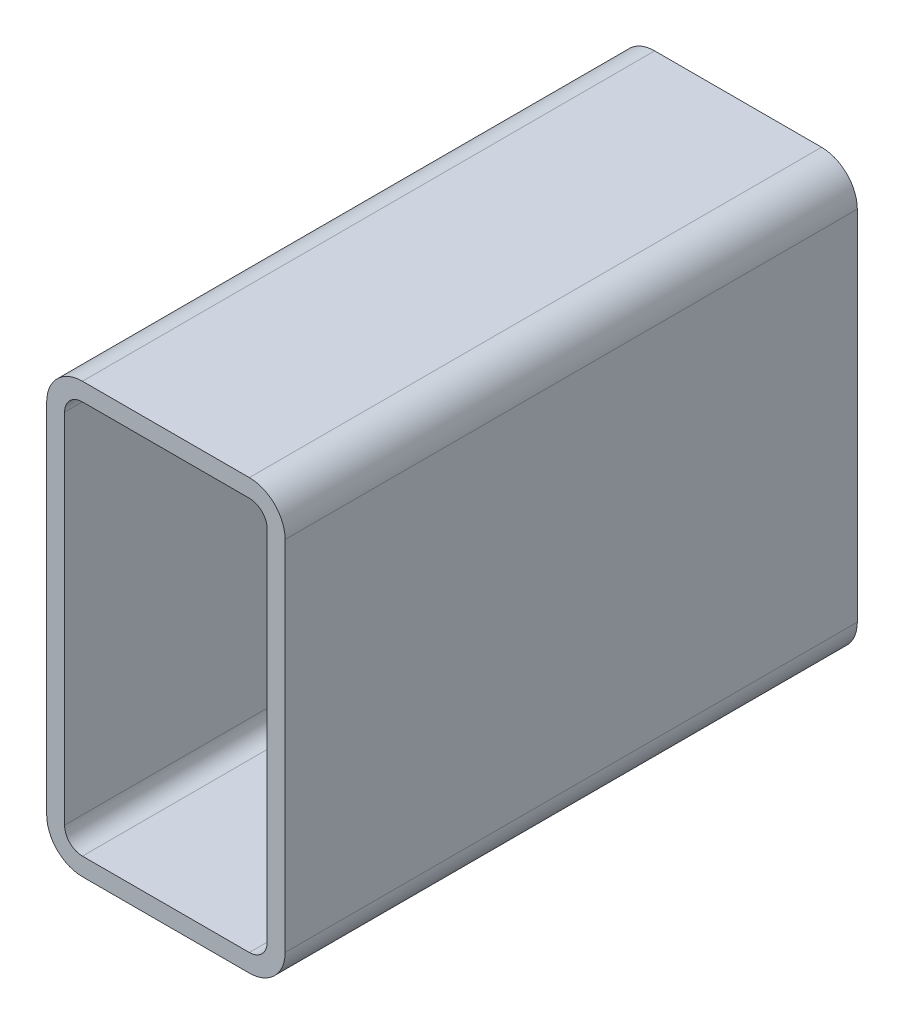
ISO-10303-21;
HEADER;
FILE_DESCRIPTION(('STEP AP214'),'2;1');
FILE_NAME('part.step','',(''),(''),'','','');
FILE_SCHEMA(('AUTOMOTIVE_DESIGN { 1 0 10303 214 1 1 1 1 }'));
ENDSEC;
DATA;
#1=APPLICATION_CONTEXT('core data for automotive mechanical design processes');
#2=APPLICATION_PROTOCOL_DEFINITION('international standard','automotive_design',2000,#1);
#3=PRODUCT_CONTEXT('',#1,'mechanical');
#4=PRODUCT('Part','Part','',(#3));
#5=PRODUCT_RELATED_PRODUCT_CATEGORY('part','',(#4));
#6=PRODUCT_DEFINITION_FORMATION('','',#4);
#7=PRODUCT_DEFINITION_CONTEXT('part definition',#1,'design');
#8=PRODUCT_DEFINITION('design','',#6,#7);
#9=PRODUCT_DEFINITION_SHAPE('','',#8);
#10=(LENGTH_UNIT() NAMED_UNIT(*) SI_UNIT(.MILLI.,.METRE.));
#11=(NAMED_UNIT(*) PLANE_ANGLE_UNIT() SI_UNIT($,.RADIAN.));
#12=(NAMED_UNIT(*) SI_UNIT($,.STERADIAN.) SOLID_ANGLE_UNIT());
#13=UNCERTAINTY_MEASURE_WITH_UNIT(LENGTH_MEASURE(1.E-05),#10,'distance_accuracy_value','');
#14=(GEOMETRIC_REPRESENTATION_CONTEXT(3) GLOBAL_UNCERTAINTY_ASSIGNED_CONTEXT((#13)) GLOBAL_UNIT_ASSIGNED_CONTEXT((#10,
#11,#12)) REPRESENTATION_CONTEXT('',''));
#15=CARTESIAN_POINT('',(0.,0.,0.));
#16=DIRECTION('',(0.,0.,1.));
#17=DIRECTION('',(1.,0.,0.));
#18=AXIS2_PLACEMENT_3D('',#15,#16,#17);
#19=CARTESIAN_POINT('',(108.811239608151,20.9932223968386,304.8));
#20=DIRECTION('',(0.,0.,1.));
#21=DIRECTION('',(1.,0.,0.));
#22=AXIS2_PLACEMENT_3D('',#19,#20,#21);
#23=PLANE('',#22);
#24=CARTESIAN_POINT('',(108.811239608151,20.9932223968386,304.8));
#25=DIRECTION('',(0.,0.,1.));
#26=DIRECTION('',(1.,0.,0.));
#27=AXIS2_PLACEMENT_3D('',#24,#25,#26);
#28=CIRCLE('',#27,19.05);
#29=CARTESIAN_POINT('',(108.811239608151,1.94322239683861,304.8));
#30=VERTEX_POINT('',#29);
#31=CARTESIAN_POINT('',(127.861239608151,20.9932223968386,304.8));
#32=VERTEX_POINT('',#31);
#33=EDGE_CURVE('E211',#30,#32,#28,.T.);
#34=ORIENTED_EDGE('',*,*,#33,.T.);
#35=DIRECTION('',(0.,1.,0.));
#36=VECTOR('',#35,1.);
#37=CARTESIAN_POINT('',(127.861239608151,211.493222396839,304.8));
#38=LINE('',#37,#36);
#39=CARTESIAN_POINT('',(127.861239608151,211.493222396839,304.8));
#40=VERTEX_POINT('',#39);
#41=EDGE_CURVE('E214',#32,#40,#38,.T.);
#42=ORIENTED_EDGE('',*,*,#41,.T.);
#43=CARTESIAN_POINT('',(108.811239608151,211.493222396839,304.8));
#44=DIRECTION('',(0.,0.,1.));
#45=DIRECTION('',(1.,0.,0.));
#46=AXIS2_PLACEMENT_3D('',#43,#44,#45);
#47=CIRCLE('',#46,19.05);
#48=CARTESIAN_POINT('',(108.811239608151,230.543222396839,304.8));
#49=VERTEX_POINT('',#48);
#50=EDGE_CURVE('E217',#40,#49,#47,.T.);
#51=ORIENTED_EDGE('',*,*,#50,.T.);
#52=DIRECTION('',(-1.,0.,0.));
#53=VECTOR('',#52,1.);
#54=CARTESIAN_POINT('',(19.9112396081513,230.543222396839,304.8));
#55=LINE('',#54,#53);
#56=CARTESIAN_POINT('',(19.9112396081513,230.543222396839,304.8));
#57=VERTEX_POINT('',#56);
#58=EDGE_CURVE('E219',#49,#57,#55,.T.);
#59=ORIENTED_EDGE('',*,*,#58,.T.);
#60=CARTESIAN_POINT('',(19.9112396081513,211.493222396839,304.8));
#61=DIRECTION('',(0.,0.,1.));
#62=DIRECTION('',(1.,0.,0.));
#63=AXIS2_PLACEMENT_3D('',#60,#61,#62);
#64=CIRCLE('',#63,19.05);
#65=CARTESIAN_POINT('',(0.8612396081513,211.493222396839,304.8));
#66=VERTEX_POINT('',#65);
#67=EDGE_CURVE('E221',#57,#66,#64,.T.);
#68=ORIENTED_EDGE('',*,*,#67,.T.);
#69=DIRECTION('',(0.,-1.,0.));
#70=VECTOR('',#69,1.);
#71=CARTESIAN_POINT('',(0.8612396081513,20.9932223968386,304.8));
#72=LINE('',#71,#70);
#73=CARTESIAN_POINT('',(0.8612396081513,20.9932223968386,304.8));
#74=VERTEX_POINT('',#73);
#75=EDGE_CURVE('E223',#66,#74,#72,.T.);
#76=ORIENTED_EDGE('',*,*,#75,.T.);
#77=CARTESIAN_POINT('',(19.9112396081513,20.9932223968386,304.8));
#78=DIRECTION('',(0.,0.,1.));
#79=DIRECTION('',(1.,0.,0.));
#80=AXIS2_PLACEMENT_3D('',#77,#78,#79);
#81=CIRCLE('',#80,19.05);
#82=CARTESIAN_POINT('',(19.9112396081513,1.94322239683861,304.8));
#83=VERTEX_POINT('',#82);
#84=EDGE_CURVE('E225',#74,#83,#81,.T.);
#85=ORIENTED_EDGE('',*,*,#84,.T.);
#86=DIRECTION('',(1.,0.,0.));
#87=VECTOR('',#86,1.);
#88=CARTESIAN_POINT('',(108.811239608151,1.94322239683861,304.8));
#89=LINE('',#88,#87);
#90=EDGE_CURVE('E227',#83,#30,#89,.T.);
#91=ORIENTED_EDGE('',*,*,#90,.T.);
#92=EDGE_LOOP('',(#34,#42,#51,#59,#68,#76,#85,#91));
#93=FACE_BOUND('',#92,.T.);
#94=DIRECTION('',(0.,-1.,0.));
#95=VECTOR('',#94,1.);
#96=CARTESIAN_POINT('',(10.3862396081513,20.9932223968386,304.8));
#97=LINE('',#96,#95);
#98=CARTESIAN_POINT('',(10.3862396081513,211.493222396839,304.8));
#99=VERTEX_POINT('',#98);
#100=CARTESIAN_POINT('',(10.3862396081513,20.9932223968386,304.8));
#101=VERTEX_POINT('',#100);
#102=EDGE_CURVE('E154',#99,#101,#97,.T.);
#103=ORIENTED_EDGE('',*,*,#102,.F.);
#104=CARTESIAN_POINT('',(19.9112396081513,211.493222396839,304.8));
#105=DIRECTION('',(0.,0.,1.));
#106=DIRECTION('',(1.,0.,0.));
#107=AXIS2_PLACEMENT_3D('',#104,#105,#106);
#108=CIRCLE('',#107,9.525);
#109=CARTESIAN_POINT('',(19.9112396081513,221.018222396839,304.8));
#110=VERTEX_POINT('',#109);
#111=EDGE_CURVE('E146',#110,#99,#108,.T.);
#112=ORIENTED_EDGE('',*,*,#111,.F.);
#113=DIRECTION('',(-1.,0.,0.));
#114=VECTOR('',#113,1.);
#115=CARTESIAN_POINT('',(19.9112396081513,221.018222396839,304.8));
#116=LINE('',#115,#114);
#117=CARTESIAN_POINT('',(108.811239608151,221.018222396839,304.8));
#118=VERTEX_POINT('',#117);
#119=EDGE_CURVE('E179',#118,#110,#116,.T.);
#120=ORIENTED_EDGE('',*,*,#119,.F.);
#121=CARTESIAN_POINT('',(108.811239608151,211.493222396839,304.8));
#122=DIRECTION('',(0.,0.,1.));
#123=DIRECTION('',(1.,0.,0.));
#124=AXIS2_PLACEMENT_3D('',#121,#122,#123);
#125=CIRCLE('',#124,9.525);
#126=CARTESIAN_POINT('',(118.336239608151,211.493222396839,304.8));
#127=VERTEX_POINT('',#126);
#128=EDGE_CURVE('E177',#127,#118,#125,.T.);
#129=ORIENTED_EDGE('',*,*,#128,.F.);
#130=DIRECTION('',(0.,1.,0.));
#131=VECTOR('',#130,1.);
#132=CARTESIAN_POINT('',(118.336239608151,211.493222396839,304.8));
#133=LINE('',#132,#131);
#134=CARTESIAN_POINT('',(118.336239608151,20.9932223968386,304.8));
#135=VERTEX_POINT('',#134);
#136=EDGE_CURVE('E175',#135,#127,#133,.T.);
#137=ORIENTED_EDGE('',*,*,#136,.F.);
#138=CARTESIAN_POINT('',(108.811239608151,20.9932223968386,304.8));
#139=DIRECTION('',(0.,0.,1.));
#140=DIRECTION('',(1.,0.,0.));
#141=AXIS2_PLACEMENT_3D('',#138,#139,#140);
#142=CIRCLE('',#141,9.52500000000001);
#143=CARTESIAN_POINT('',(108.811239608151,11.4682223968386,304.8));
#144=VERTEX_POINT('',#143);
#145=EDGE_CURVE('E173',#144,#135,#142,.T.);
#146=ORIENTED_EDGE('',*,*,#145,.F.);
#147=DIRECTION('',(1.,0.,0.));
#148=VECTOR('',#147,1.);
#149=CARTESIAN_POINT('',(108.811239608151,11.4682223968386,304.8));
#150=LINE('',#149,#148);
#151=CARTESIAN_POINT('',(19.9112396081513,11.4682223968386,304.8));
#152=VERTEX_POINT('',#151);
#153=EDGE_CURVE('E169',#152,#144,#150,.T.);
#154=ORIENTED_EDGE('',*,*,#153,.F.);
#155=CARTESIAN_POINT('',(19.9112396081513,20.9932223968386,304.8));
#156=DIRECTION('',(0.,0.,1.));
#157=DIRECTION('',(1.,0.,0.));
#158=AXIS2_PLACEMENT_3D('',#155,#156,#157);
#159=CIRCLE('',#158,9.525);
#160=EDGE_CURVE('E167',#101,#152,#159,.T.);
#161=ORIENTED_EDGE('',*,*,#160,.F.);
#162=EDGE_LOOP('',(#103,#112,#120,#129,#137,#146,#154,#161));
#163=FACE_BOUND('',#162,.T.);
#164=ADVANCED_FACE('F33',(#93,#163),#23,.T.);
#165=CARTESIAN_POINT('',(108.811239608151,20.9932223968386,0.));
#166=DIRECTION('',(0.,0.,1.));
#167=DIRECTION('',(1.,0.,0.));
#168=AXIS2_PLACEMENT_3D('',#165,#166,#167);
#169=PLANE('',#168);
#170=CARTESIAN_POINT('',(108.811239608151,20.9932223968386,0.));
#171=DIRECTION('',(0.,0.,1.));
#172=DIRECTION('',(1.,0.,0.));
#173=AXIS2_PLACEMENT_3D('',#170,#171,#172);
#174=CIRCLE('',#173,19.05);
#175=CARTESIAN_POINT('',(108.811239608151,1.94322239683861,0.));
#176=VERTEX_POINT('',#175);
#177=CARTESIAN_POINT('',(127.861239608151,20.9932223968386,0.));
#178=VERTEX_POINT('',#177);
#179=EDGE_CURVE('E162',#176,#178,#174,.T.);
#180=ORIENTED_EDGE('',*,*,#179,.F.);
#181=DIRECTION('',(1.,0.,0.));
#182=VECTOR('',#181,1.);
#183=CARTESIAN_POINT('',(108.811239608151,1.94322239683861,0.));
#184=LINE('',#183,#182);
#185=CARTESIAN_POINT('',(19.9112396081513,1.94322239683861,0.));
#186=VERTEX_POINT('',#185);
#187=EDGE_CURVE('E215',#186,#176,#184,.T.);
#188=ORIENTED_EDGE('',*,*,#187,.F.);
#189=CARTESIAN_POINT('',(19.9112396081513,20.9932223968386,0.));
#190=DIRECTION('',(0.,0.,1.));
#191=DIRECTION('',(1.,0.,0.));
#192=AXIS2_PLACEMENT_3D('',#189,#190,#191);
#193=CIRCLE('',#192,19.05);
#194=CARTESIAN_POINT('',(0.8612396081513,20.9932223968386,0.));
#195=VERTEX_POINT('',#194);
#196=EDGE_CURVE('E242',#195,#186,#193,.T.);
#197=ORIENTED_EDGE('',*,*,#196,.F.);
#198=DIRECTION('',(0.,-1.,0.));
#199=VECTOR('',#198,1.);
#200=CARTESIAN_POINT('',(0.8612396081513,20.9932223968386,0.));
#201=LINE('',#200,#199);
#202=CARTESIAN_POINT('',(0.8612396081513,211.493222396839,0.));
#203=VERTEX_POINT('',#202);
#204=EDGE_CURVE('E240',#203,#195,#201,.T.);
#205=ORIENTED_EDGE('',*,*,#204,.F.);
#206=CARTESIAN_POINT('',(19.9112396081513,211.493222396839,0.));
#207=DIRECTION('',(0.,0.,1.));
#208=DIRECTION('',(1.,0.,0.));
#209=AXIS2_PLACEMENT_3D('',#206,#207,#208);
#210=CIRCLE('',#209,19.05);
#211=CARTESIAN_POINT('',(19.9112396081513,230.543222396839,0.));
#212=VERTEX_POINT('',#211);
#213=EDGE_CURVE('E238',#212,#203,#210,.T.);
#214=ORIENTED_EDGE('',*,*,#213,.F.);
#215=DIRECTION('',(-1.,0.,0.));
#216=VECTOR('',#215,1.);
#217=CARTESIAN_POINT('',(19.9112396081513,230.543222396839,0.));
#218=LINE('',#217,#216);
#219=CARTESIAN_POINT('',(108.811239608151,230.543222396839,0.));
#220=VERTEX_POINT('',#219);
#221=EDGE_CURVE('E236',#220,#212,#218,.T.);
#222=ORIENTED_EDGE('',*,*,#221,.F.);
#223=CARTESIAN_POINT('',(108.811239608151,211.493222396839,0.));
#224=DIRECTION('',(0.,0.,1.));
#225=DIRECTION('',(1.,0.,0.));
#226=AXIS2_PLACEMENT_3D('',#223,#224,#225);
#227=CIRCLE('',#226,19.05);
#228=CARTESIAN_POINT('',(127.861239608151,211.493222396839,0.));
#229=VERTEX_POINT('',#228);
#230=EDGE_CURVE('E234',#229,#220,#227,.T.);
#231=ORIENTED_EDGE('',*,*,#230,.F.);
#232=DIRECTION('',(0.,1.,0.));
#233=VECTOR('',#232,1.);
#234=CARTESIAN_POINT('',(127.861239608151,211.493222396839,0.));
#235=LINE('',#234,#233);
#236=EDGE_CURVE('E232',#178,#229,#235,.T.);
#237=ORIENTED_EDGE('',*,*,#236,.F.);
#238=EDGE_LOOP('',(#180,#188,#197,#205,#214,#222,#231,#237));
#239=FACE_BOUND('',#238,.T.);
#240=CARTESIAN_POINT('',(19.9112396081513,211.493222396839,0.));
#241=DIRECTION('',(0.,0.,1.));
#242=DIRECTION('',(1.,0.,0.));
#243=AXIS2_PLACEMENT_3D('',#240,#241,#242);
#244=CIRCLE('',#243,9.525);
#245=CARTESIAN_POINT('',(19.9112396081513,221.018222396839,0.));
#246=VERTEX_POINT('',#245);
#247=CARTESIAN_POINT('',(10.3862396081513,211.493222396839,0.));
#248=VERTEX_POINT('',#247);
#249=EDGE_CURVE('E56',#246,#248,#244,.T.);
#250=ORIENTED_EDGE('',*,*,#249,.T.);
#251=DIRECTION('',(0.,-1.,0.));
#252=VECTOR('',#251,1.);
#253=CARTESIAN_POINT('',(10.3862396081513,20.9932223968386,0.));
#254=LINE('',#253,#252);
#255=CARTESIAN_POINT('',(10.3862396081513,20.9932223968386,0.));
#256=VERTEX_POINT('',#255);
#257=EDGE_CURVE('E161',#248,#256,#254,.T.);
#258=ORIENTED_EDGE('',*,*,#257,.T.);
#259=CARTESIAN_POINT('',(19.9112396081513,20.9932223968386,0.));
#260=DIRECTION('',(0.,0.,1.));
#261=DIRECTION('',(1.,0.,0.));
#262=AXIS2_PLACEMENT_3D('',#259,#260,#261);
#263=CIRCLE('',#262,9.525);
#264=CARTESIAN_POINT('',(19.9112396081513,11.4682223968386,0.));
#265=VERTEX_POINT('',#264);
#266=EDGE_CURVE('E183',#256,#265,#263,.T.);
#267=ORIENTED_EDGE('',*,*,#266,.T.);
#268=DIRECTION('',(1.,0.,0.));
#269=VECTOR('',#268,1.);
#270=CARTESIAN_POINT('',(108.811239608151,11.4682223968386,0.));
#271=LINE('',#270,#269);
#272=CARTESIAN_POINT('',(108.811239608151,11.4682223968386,0.));
#273=VERTEX_POINT('',#272);
#274=EDGE_CURVE('E186',#265,#273,#271,.T.);
#275=ORIENTED_EDGE('',*,*,#274,.T.);
#276=CARTESIAN_POINT('',(108.811239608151,20.9932223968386,0.));
#277=DIRECTION('',(0.,0.,1.));
#278=DIRECTION('',(1.,0.,0.));
#279=AXIS2_PLACEMENT_3D('',#276,#277,#278);
#280=CIRCLE('',#279,9.52500000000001);
#281=CARTESIAN_POINT('',(118.336239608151,20.9932223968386,0.));
#282=VERTEX_POINT('',#281);
#283=EDGE_CURVE('E189',#273,#282,#280,.T.);
#284=ORIENTED_EDGE('',*,*,#283,.T.);
#285=DIRECTION('',(0.,1.,0.));
#286=VECTOR('',#285,1.);
#287=CARTESIAN_POINT('',(118.336239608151,211.493222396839,0.));
#288=LINE('',#287,#286);
#289=CARTESIAN_POINT('',(118.336239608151,211.493222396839,0.));
#290=VERTEX_POINT('',#289);
#291=EDGE_CURVE('E192',#282,#290,#288,.T.);
#292=ORIENTED_EDGE('',*,*,#291,.T.);
#293=CARTESIAN_POINT('',(108.811239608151,211.493222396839,0.));
#294=DIRECTION('',(0.,0.,1.));
#295=DIRECTION('',(1.,0.,0.));
#296=AXIS2_PLACEMENT_3D('',#293,#294,#295);
#297=CIRCLE('',#296,9.525);
#298=CARTESIAN_POINT('',(108.811239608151,221.018222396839,0.));
#299=VERTEX_POINT('',#298);
#300=EDGE_CURVE('E195',#290,#299,#297,.T.);
#301=ORIENTED_EDGE('',*,*,#300,.T.);
#302=DIRECTION('',(-1.,0.,0.));
#303=VECTOR('',#302,1.);
#304=CARTESIAN_POINT('',(19.9112396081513,221.018222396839,0.));
#305=LINE('',#304,#303);
#306=EDGE_CURVE('E155',#299,#246,#305,.T.);
#307=ORIENTED_EDGE('',*,*,#306,.T.);
#308=EDGE_LOOP('',(#250,#258,#267,#275,#284,#292,#301,#307));
#309=FACE_BOUND('',#308,.T.);
#310=ADVANCED_FACE('F272',(#239,#309),#169,.F.);
#311=CARTESIAN_POINT('',(108.811239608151,20.9932223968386,304.8));
#312=DIRECTION('',(0.,0.,-1.));
#313=DIRECTION('',(-1.,0.,0.));
#314=AXIS2_PLACEMENT_3D('',#311,#312,#313);
#315=CYLINDRICAL_SURFACE('',#314,19.05);
#316=ORIENTED_EDGE('',*,*,#179,.T.);
#317=DIRECTION('',(0.,0.,-1.));
#318=VECTOR('',#317,1.);
#319=CARTESIAN_POINT('',(127.861239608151,20.9932223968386,304.8));
#320=LINE('',#319,#318);
#321=EDGE_CURVE('E11',#32,#178,#320,.T.);
#322=ORIENTED_EDGE('',*,*,#321,.F.);
#323=ORIENTED_EDGE('',*,*,#33,.F.);
#324=DIRECTION('',(0.,0.,-1.));
#325=VECTOR('',#324,1.);
#326=CARTESIAN_POINT('',(108.811239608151,1.94322239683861,304.8));
#327=LINE('',#326,#325);
#328=EDGE_CURVE('E229',#30,#176,#327,.T.);
#329=ORIENTED_EDGE('',*,*,#328,.T.);
#330=EDGE_LOOP('',(#316,#322,#323,#329));
#331=FACE_BOUND('',#330,.T.);
#332=ADVANCED_FACE('F35',(#331),#315,.T.);
#333=CARTESIAN_POINT('',(127.861239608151,211.493222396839,304.8));
#334=DIRECTION('',(-1.,0.,0.));
#335=DIRECTION('',(0.,0.,1.));
#336=AXIS2_PLACEMENT_3D('',#333,#334,#335);
#337=PLANE('',#336);
#338=ORIENTED_EDGE('',*,*,#236,.T.);
#339=DIRECTION('',(0.,0.,-1.));
#340=VECTOR('',#339,1.);
#341=CARTESIAN_POINT('',(127.861239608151,211.493222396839,304.8));
#342=LINE('',#341,#340);
#343=EDGE_CURVE('E41',#40,#229,#342,.T.);
#344=ORIENTED_EDGE('',*,*,#343,.F.);
#345=ORIENTED_EDGE('',*,*,#41,.F.);
#346=ORIENTED_EDGE('',*,*,#321,.T.);
#347=EDGE_LOOP('',(#338,#344,#345,#346));
#348=FACE_BOUND('',#347,.T.);
#349=ADVANCED_FACE('F289',(#348),#337,.F.);
#350=CARTESIAN_POINT('',(108.811239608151,211.493222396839,304.8));
#351=DIRECTION('',(0.,0.,-1.));
#352=DIRECTION('',(-1.,0.,0.));
#353=AXIS2_PLACEMENT_3D('',#350,#351,#352);
#354=CYLINDRICAL_SURFACE('',#353,19.05);
#355=ORIENTED_EDGE('',*,*,#230,.T.);
#356=DIRECTION('',(0.,0.,-1.));
#357=VECTOR('',#356,1.);
#358=CARTESIAN_POINT('',(108.811239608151,230.543222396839,304.8));
#359=LINE('',#358,#357);
#360=EDGE_CURVE('E259',#49,#220,#359,.T.);
#361=ORIENTED_EDGE('',*,*,#360,.F.);
#362=ORIENTED_EDGE('',*,*,#50,.F.);
#363=ORIENTED_EDGE('',*,*,#343,.T.);
#364=EDGE_LOOP('',(#355,#361,#362,#363));
#365=FACE_BOUND('',#364,.T.);
#366=ADVANCED_FACE('F266',(#365),#354,.T.);
#367=CARTESIAN_POINT('',(19.9112396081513,230.543222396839,304.8));
#368=DIRECTION('',(0.,-1.,0.));
#369=DIRECTION('',(0.,0.,-1.));
#370=AXIS2_PLACEMENT_3D('',#367,#368,#369);
#371=PLANE('',#370);
#372=ORIENTED_EDGE('',*,*,#221,.T.);
#373=DIRECTION('',(0.,0.,-1.));
#374=VECTOR('',#373,1.);
#375=CARTESIAN_POINT('',(19.9112396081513,230.543222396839,304.8));
#376=LINE('',#375,#374);
#377=EDGE_CURVE('E256',#57,#212,#376,.T.);
#378=ORIENTED_EDGE('',*,*,#377,.F.);
#379=ORIENTED_EDGE('',*,*,#58,.F.);
#380=ORIENTED_EDGE('',*,*,#360,.T.);
#381=EDGE_LOOP('',(#372,#378,#379,#380));
#382=FACE_BOUND('',#381,.T.);
#383=ADVANCED_FACE('F278',(#382),#371,.F.);
#384=CARTESIAN_POINT('',(19.9112396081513,211.493222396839,304.8));
#385=DIRECTION('',(0.,0.,-1.));
#386=DIRECTION('',(-1.,0.,0.));
#387=AXIS2_PLACEMENT_3D('',#384,#385,#386);
#388=CYLINDRICAL_SURFACE('',#387,19.05);
#389=ORIENTED_EDGE('',*,*,#213,.T.);
#390=DIRECTION('',(0.,0.,-1.));
#391=VECTOR('',#390,1.);
#392=CARTESIAN_POINT('',(0.8612396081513,211.493222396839,304.8));
#393=LINE('',#392,#391);
#394=EDGE_CURVE('E253',#66,#203,#393,.T.);
#395=ORIENTED_EDGE('',*,*,#394,.F.);
#396=ORIENTED_EDGE('',*,*,#67,.F.);
#397=ORIENTED_EDGE('',*,*,#377,.T.);
#398=EDGE_LOOP('',(#389,#395,#396,#397));
#399=FACE_BOUND('',#398,.T.);
#400=ADVANCED_FACE('F282',(#399),#388,.T.);
#401=CARTESIAN_POINT('',(0.8612396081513,20.9932223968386,304.8));
#402=DIRECTION('',(1.,0.,0.));
#403=DIRECTION('',(0.,0.,-1.));
#404=AXIS2_PLACEMENT_3D('',#401,#402,#403);
#405=PLANE('',#404);
#406=ORIENTED_EDGE('',*,*,#204,.T.);
#407=DIRECTION('',(0.,0.,-1.));
#408=VECTOR('',#407,1.);
#409=CARTESIAN_POINT('',(0.8612396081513,20.9932223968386,304.8));
#410=LINE('',#409,#408);
#411=EDGE_CURVE('E250',#74,#195,#410,.T.);
#412=ORIENTED_EDGE('',*,*,#411,.F.);
#413=ORIENTED_EDGE('',*,*,#75,.F.);
#414=ORIENTED_EDGE('',*,*,#394,.T.);
#415=EDGE_LOOP('',(#406,#412,#413,#414));
#416=FACE_BOUND('',#415,.T.);
#417=ADVANCED_FACE('F302',(#416),#405,.F.);
#418=CARTESIAN_POINT('',(19.9112396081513,20.9932223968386,304.8));
#419=DIRECTION('',(0.,0.,-1.));
#420=DIRECTION('',(-1.,0.,0.));
#421=AXIS2_PLACEMENT_3D('',#418,#419,#420);
#422=CYLINDRICAL_SURFACE('',#421,19.05);
#423=ORIENTED_EDGE('',*,*,#196,.T.);
#424=DIRECTION('',(0.,0.,-1.));
#425=VECTOR('',#424,1.);
#426=CARTESIAN_POINT('',(19.9112396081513,1.94322239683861,304.8));
#427=LINE('',#426,#425);
#428=EDGE_CURVE('E247',#83,#186,#427,.T.);
#429=ORIENTED_EDGE('',*,*,#428,.F.);
#430=ORIENTED_EDGE('',*,*,#84,.F.);
#431=ORIENTED_EDGE('',*,*,#411,.T.);
#432=EDGE_LOOP('',(#423,#429,#430,#431));
#433=FACE_BOUND('',#432,.T.);
#434=ADVANCED_FACE('F300',(#433),#422,.T.);
#435=CARTESIAN_POINT('',(108.811239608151,1.94322239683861,304.8));
#436=DIRECTION('',(0.,1.,0.));
#437=DIRECTION('',(0.,0.,1.));
#438=AXIS2_PLACEMENT_3D('',#435,#436,#437);
#439=PLANE('',#438);
#440=ORIENTED_EDGE('',*,*,#187,.T.);
#441=ORIENTED_EDGE('',*,*,#328,.F.);
#442=ORIENTED_EDGE('',*,*,#90,.F.);
#443=ORIENTED_EDGE('',*,*,#428,.T.);
#444=EDGE_LOOP('',(#440,#441,#442,#443));
#445=FACE_BOUND('',#444,.T.);
#446=ADVANCED_FACE('F295',(#445),#439,.F.);
#447=CARTESIAN_POINT('',(19.9112396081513,211.493222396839,304.8));
#448=DIRECTION('',(0.,0.,-1.));
#449=DIRECTION('',(-1.,0.,0.));
#450=AXIS2_PLACEMENT_3D('',#447,#448,#449);
#451=CYLINDRICAL_SURFACE('',#450,9.525);
#452=ORIENTED_EDGE('',*,*,#249,.F.);
#453=DIRECTION('',(0.,0.,-1.));
#454=VECTOR('',#453,1.);
#455=CARTESIAN_POINT('',(19.9112396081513,221.018222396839,304.8));
#456=LINE('',#455,#454);
#457=EDGE_CURVE('E150',#110,#246,#456,.T.);
#458=ORIENTED_EDGE('',*,*,#457,.F.);
#459=ORIENTED_EDGE('',*,*,#111,.T.);
#460=DIRECTION('',(0.,0.,-1.));
#461=VECTOR('',#460,1.);
#462=CARTESIAN_POINT('',(10.3862396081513,211.493222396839,304.8));
#463=LINE('',#462,#461);
#464=EDGE_CURVE('E149',#99,#248,#463,.T.);
#465=ORIENTED_EDGE('',*,*,#464,.T.);
#466=EDGE_LOOP('',(#452,#458,#459,#465));
#467=FACE_BOUND('',#466,.T.);
#468=ADVANCED_FACE('F148',(#467),#451,.F.);
#469=CARTESIAN_POINT('',(10.3862396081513,20.9932223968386,304.8));
#470=DIRECTION('',(1.,0.,0.));
#471=DIRECTION('',(0.,0.,-1.));
#472=AXIS2_PLACEMENT_3D('',#469,#470,#471);
#473=PLANE('',#472);
#474=ORIENTED_EDGE('',*,*,#257,.F.);
#475=ORIENTED_EDGE('',*,*,#464,.F.);
#476=ORIENTED_EDGE('',*,*,#102,.T.);
#477=DIRECTION('',(0.,0.,-1.));
#478=VECTOR('',#477,1.);
#479=CARTESIAN_POINT('',(10.3862396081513,20.9932223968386,304.8));
#480=LINE('',#479,#478);
#481=EDGE_CURVE('E163',#101,#256,#480,.T.);
#482=ORIENTED_EDGE('',*,*,#481,.T.);
#483=EDGE_LOOP('',(#474,#475,#476,#482));
#484=FACE_BOUND('',#483,.T.);
#485=ADVANCED_FACE('F158',(#484),#473,.T.);
#486=CARTESIAN_POINT('',(19.9112396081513,20.9932223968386,304.8));
#487=DIRECTION('',(0.,0.,-1.));
#488=DIRECTION('',(-1.,0.,0.));
#489=AXIS2_PLACEMENT_3D('',#486,#487,#488);
#490=CYLINDRICAL_SURFACE('',#489,9.525);
#491=ORIENTED_EDGE('',*,*,#266,.F.);
#492=ORIENTED_EDGE('',*,*,#481,.F.);
#493=ORIENTED_EDGE('',*,*,#160,.T.);
#494=DIRECTION('',(0.,0.,-1.));
#495=VECTOR('',#494,1.);
#496=CARTESIAN_POINT('',(19.9112396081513,11.4682223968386,304.8));
#497=LINE('',#496,#495);
#498=EDGE_CURVE('E208',#152,#265,#497,.T.);
#499=ORIENTED_EDGE('',*,*,#498,.T.);
#500=EDGE_LOOP('',(#491,#492,#493,#499));
#501=FACE_BOUND('',#500,.T.);
#502=ADVANCED_FACE('F327',(#501),#490,.F.);
#503=CARTESIAN_POINT('',(108.811239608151,11.4682223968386,304.8));
#504=DIRECTION('',(0.,1.,0.));
#505=DIRECTION('',(0.,0.,1.));
#506=AXIS2_PLACEMENT_3D('',#503,#504,#505);
#507=PLANE('',#506);
#508=ORIENTED_EDGE('',*,*,#274,.F.);
#509=ORIENTED_EDGE('',*,*,#498,.F.);
#510=ORIENTED_EDGE('',*,*,#153,.T.);
#511=DIRECTION('',(0.,0.,-1.));
#512=VECTOR('',#511,1.);
#513=CARTESIAN_POINT('',(108.811239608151,11.4682223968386,304.8));
#514=LINE('',#513,#512);
#515=EDGE_CURVE('E206',#144,#273,#514,.T.);
#516=ORIENTED_EDGE('',*,*,#515,.T.);
#517=EDGE_LOOP('',(#508,#509,#510,#516));
#518=FACE_BOUND('',#517,.T.);
#519=ADVANCED_FACE('F331',(#518),#507,.T.);
#520=CARTESIAN_POINT('',(108.811239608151,20.9932223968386,304.8));
#521=DIRECTION('',(0.,0.,-1.));
#522=DIRECTION('',(-1.,0.,0.));
#523=AXIS2_PLACEMENT_3D('',#520,#521,#522);
#524=CYLINDRICAL_SURFACE('',#523,9.52500000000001);
#525=ORIENTED_EDGE('',*,*,#283,.F.);
#526=ORIENTED_EDGE('',*,*,#515,.F.);
#527=ORIENTED_EDGE('',*,*,#145,.T.);
#528=DIRECTION('',(0.,0.,-1.));
#529=VECTOR('',#528,1.);
#530=CARTESIAN_POINT('',(118.336239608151,20.9932223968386,304.8));
#531=LINE('',#530,#529);
#532=EDGE_CURVE('E204',#135,#282,#531,.T.);
#533=ORIENTED_EDGE('',*,*,#532,.T.);
#534=EDGE_LOOP('',(#525,#526,#527,#533));
#535=FACE_BOUND('',#534,.T.);
#536=ADVANCED_FACE('F337',(#535),#524,.F.);
#537=CARTESIAN_POINT('',(118.336239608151,211.493222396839,304.8));
#538=DIRECTION('',(-1.,0.,0.));
#539=DIRECTION('',(0.,0.,1.));
#540=AXIS2_PLACEMENT_3D('',#537,#538,#539);
#541=PLANE('',#540);
#542=ORIENTED_EDGE('',*,*,#291,.F.);
#543=ORIENTED_EDGE('',*,*,#532,.F.);
#544=ORIENTED_EDGE('',*,*,#136,.T.);
#545=DIRECTION('',(0.,0.,-1.));
#546=VECTOR('',#545,1.);
#547=CARTESIAN_POINT('',(118.336239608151,211.493222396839,304.8));
#548=LINE('',#547,#546);
#549=EDGE_CURVE('E202',#127,#290,#548,.T.);
#550=ORIENTED_EDGE('',*,*,#549,.T.);
#551=EDGE_LOOP('',(#542,#543,#544,#550));
#552=FACE_BOUND('',#551,.T.);
#553=ADVANCED_FACE('F341',(#552),#541,.T.);
#554=CARTESIAN_POINT('',(108.811239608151,211.493222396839,304.8));
#555=DIRECTION('',(0.,0.,-1.));
#556=DIRECTION('',(-1.,0.,0.));
#557=AXIS2_PLACEMENT_3D('',#554,#555,#556);
#558=CYLINDRICAL_SURFACE('',#557,9.525);
#559=ORIENTED_EDGE('',*,*,#300,.F.);
#560=ORIENTED_EDGE('',*,*,#549,.F.);
#561=ORIENTED_EDGE('',*,*,#128,.T.);
#562=DIRECTION('',(0.,0.,-1.));
#563=VECTOR('',#562,1.);
#564=CARTESIAN_POINT('',(108.811239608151,221.018222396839,304.8));
#565=LINE('',#564,#563);
#566=EDGE_CURVE('E48',#118,#299,#565,.T.);
#567=ORIENTED_EDGE('',*,*,#566,.T.);
#568=EDGE_LOOP('',(#559,#560,#561,#567));
#569=FACE_BOUND('',#568,.T.);
#570=ADVANCED_FACE('F345',(#569),#558,.F.);
#571=CARTESIAN_POINT('',(19.9112396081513,221.018222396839,304.8));
#572=DIRECTION('',(0.,-1.,0.));
#573=DIRECTION('',(0.,0.,-1.));
#574=AXIS2_PLACEMENT_3D('',#571,#572,#573);
#575=PLANE('',#574);
#576=ORIENTED_EDGE('',*,*,#306,.F.);
#577=ORIENTED_EDGE('',*,*,#566,.F.);
#578=ORIENTED_EDGE('',*,*,#119,.T.);
#579=ORIENTED_EDGE('',*,*,#457,.T.);
#580=EDGE_LOOP('',(#576,#577,#578,#579));
#581=FACE_BOUND('',#580,.T.);
#582=ADVANCED_FACE('F349',(#581),#575,.T.);
#583=CLOSED_SHELL('',(#164,#310,#332,#349,#366,#383,#400,#417,#434,#446,#468,#485,#502,#519,
#536,#553,#570,#582));
#584=MANIFOLD_SOLID_BREP('B2',#583);
#585=ADVANCED_BREP_SHAPE_REPRESENTATION('',(#18,#584),#14);
#586=SHAPE_DEFINITION_REPRESENTATION(#9,#585);
ENDSEC;
END-ISO-10303-21;
